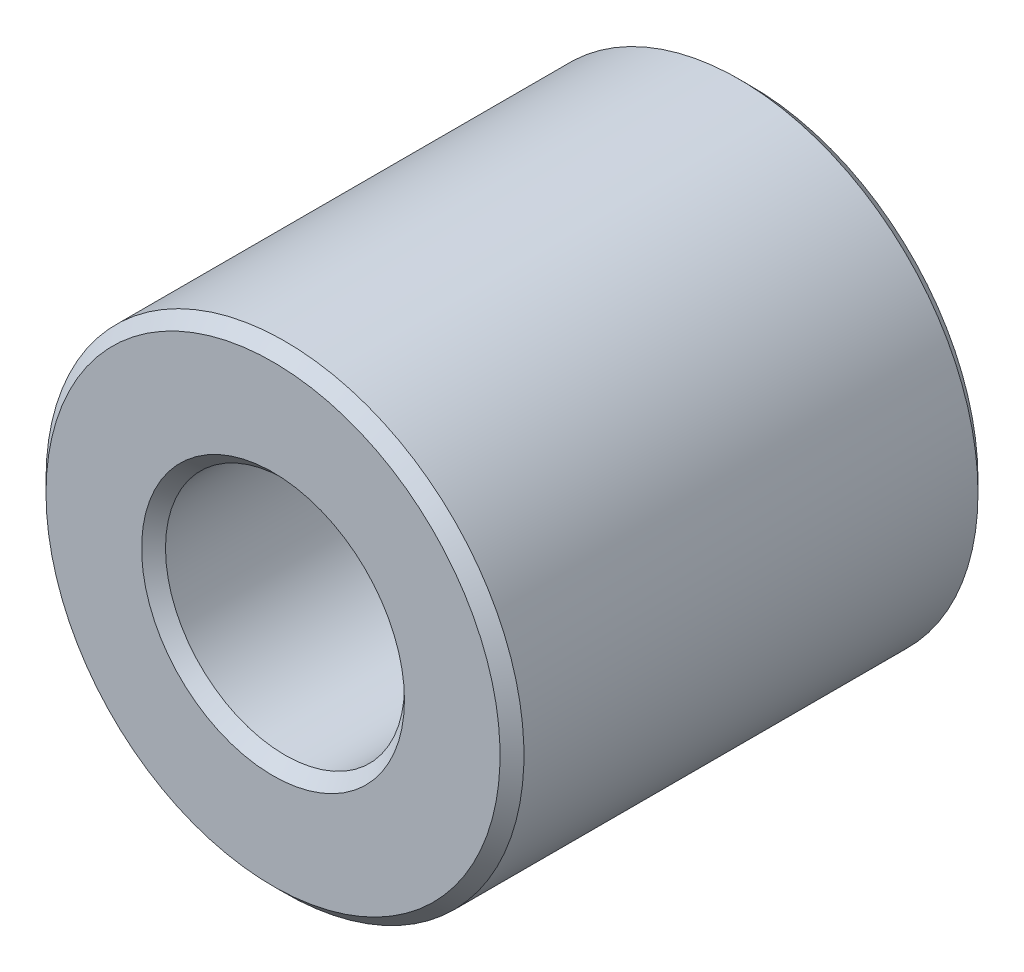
from build123d import *

# Parameters (mm, degrees)
SKETCH1_R           = 30
SKETCH1_R_2         = 15
BOSS_EXTRUDE1_DEPTH = 30
CHAMFER1_SIZE       = 1.5


with BuildPart() as part:
    # Sketch1 → Boss-Extrude1 (new, symmetric)
    with BuildSketch(Plane.XY):
        Circle(SKETCH1_R)
        Circle(SKETCH1_R_2, mode=Mode.SUBTRACT)
    extrude(amount=BOSS_EXTRUDE1_DEPTH, both=True)

    # Chamfer1
    chamfer1_edges = [part.edges().sort_by_distance(p)[0] for p in [
        (-30, 0, -30),
        (-30, 0, 30),
        (-15, 0, -30),
        (-15, 0, 30),
    ]]
    chamfer(chamfer1_edges, length=CHAMFER1_SIZE)


solid = part.part
